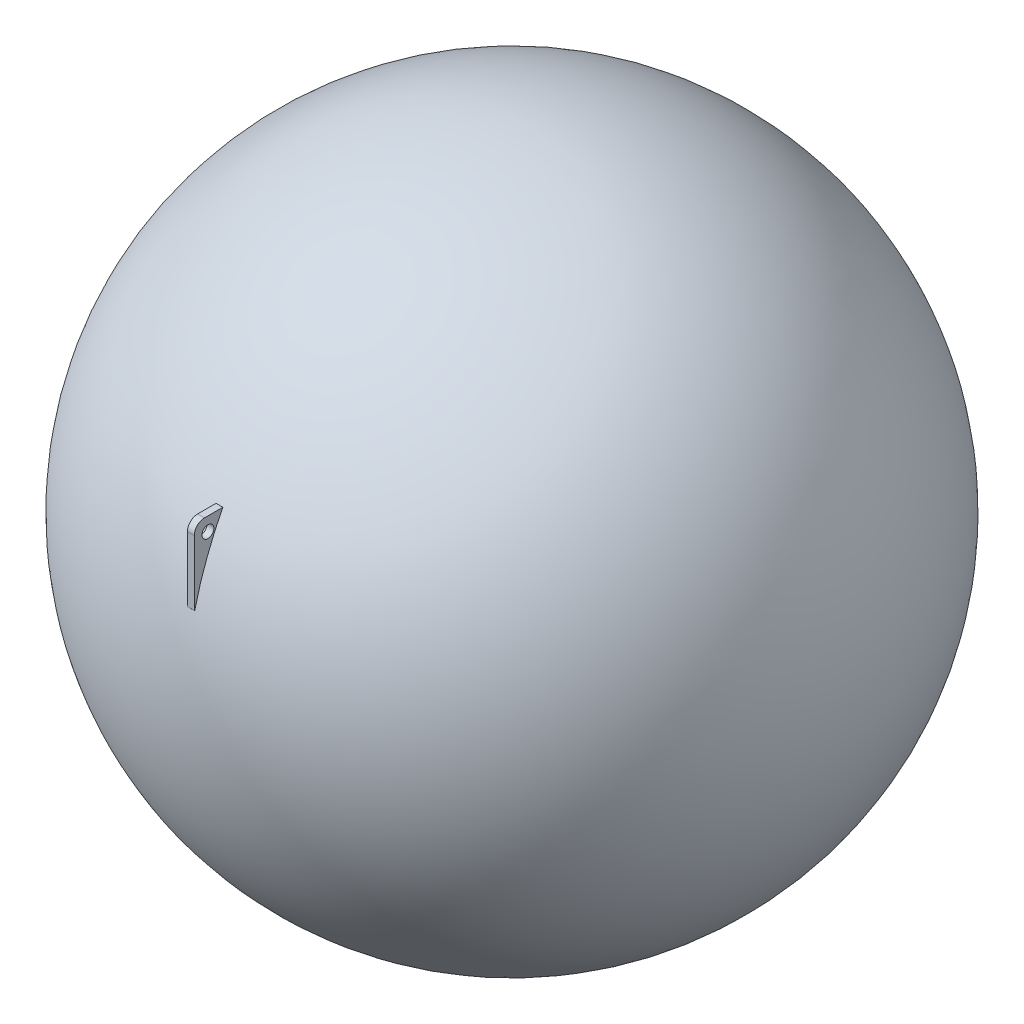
ISO-10303-21;
HEADER;
FILE_DESCRIPTION(('STEP AP214'),'2;1');
FILE_NAME('part.step','',(''),(''),'','','');
FILE_SCHEMA(('AUTOMOTIVE_DESIGN { 1 0 10303 214 1 1 1 1 }'));
ENDSEC;
DATA;
#1=APPLICATION_CONTEXT('core data for automotive mechanical design processes');
#2=APPLICATION_PROTOCOL_DEFINITION('international standard','automotive_design',2000,#1);
#3=PRODUCT_CONTEXT('',#1,'mechanical');
#4=PRODUCT('Part','Part','',(#3));
#5=PRODUCT_RELATED_PRODUCT_CATEGORY('part','',(#4));
#6=PRODUCT_DEFINITION_FORMATION('','',#4);
#7=PRODUCT_DEFINITION_CONTEXT('part definition',#1,'design');
#8=PRODUCT_DEFINITION('design','',#6,#7);
#9=PRODUCT_DEFINITION_SHAPE('','',#8);
#10=(LENGTH_UNIT() NAMED_UNIT(*) SI_UNIT(.MILLI.,.METRE.));
#11=(NAMED_UNIT(*) PLANE_ANGLE_UNIT() SI_UNIT($,.RADIAN.));
#12=(NAMED_UNIT(*) SI_UNIT($,.STERADIAN.) SOLID_ANGLE_UNIT());
#13=UNCERTAINTY_MEASURE_WITH_UNIT(LENGTH_MEASURE(1.E-05),#10,'distance_accuracy_value','');
#14=(GEOMETRIC_REPRESENTATION_CONTEXT(3) GLOBAL_UNCERTAINTY_ASSIGNED_CONTEXT((#13)) GLOBAL_UNIT_ASSIGNED_CONTEXT((#10,
#11,#12)) REPRESENTATION_CONTEXT('',''));
#15=CARTESIAN_POINT('',(0.,0.,0.));
#16=DIRECTION('',(0.,0.,1.));
#17=DIRECTION('',(1.,0.,0.));
#18=AXIS2_PLACEMENT_3D('',#15,#16,#17);
#19=CARTESIAN_POINT('',(0.,0.,0.));
#20=DIRECTION('',(0.,0.,-1.));
#21=DIRECTION('',(1.,0.,0.));
#22=AXIS2_PLACEMENT_3D('',#19,#20,#21);
#23=SPHERICAL_SURFACE('',#22,1225.55);
#24=CARTESIAN_POINT('',(-12.6999999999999,0.,0.));
#25=DIRECTION('',(-1.,0.,0.));
#26=DIRECTION('',(0.,-1.,0.));
#27=AXIS2_PLACEMENT_3D('',#24,#25,#26);
#28=CIRCLE('',#27,1225.48419512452);
#29=CARTESIAN_POINT('',(-12.7,285.75,1191.70401106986));
#30=VERTEX_POINT('',#29);
#31=CARTESIAN_POINT('',(-12.7,565.15,1087.38998983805));
#32=VERTEX_POINT('',#31);
#33=EDGE_CURVE('E100',#30,#32,#28,.T.);
#34=ORIENTED_EDGE('',*,*,#33,.T.);
#35=CARTESIAN_POINT('',(0.,565.15,0.));
#36=DIRECTION('',(0.,1.,0.));
#37=DIRECTION('',(0.,0.,1.));
#38=AXIS2_PLACEMENT_3D('',#35,#36,#37);
#39=CIRCLE('',#38,1087.46415113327);
#40=CARTESIAN_POINT('',(12.7,565.15,1087.38998983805));
#41=VERTEX_POINT('',#40);
#42=EDGE_CURVE('E96',#32,#41,#39,.T.);
#43=ORIENTED_EDGE('',*,*,#42,.T.);
#44=CARTESIAN_POINT('',(12.6999999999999,0.,0.));
#45=DIRECTION('',(1.,0.,0.));
#46=DIRECTION('',(0.,1.,0.));
#47=AXIS2_PLACEMENT_3D('',#44,#45,#46);
#48=CIRCLE('',#47,1225.48419512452);
#49=CARTESIAN_POINT('',(12.7,285.75,1191.70401106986));
#50=VERTEX_POINT('',#49);
#51=EDGE_CURVE('E87',#41,#50,#48,.T.);
#52=ORIENTED_EDGE('',*,*,#51,.T.);
#53=CARTESIAN_POINT('',(0.,285.75,0.));
#54=DIRECTION('',(0.,-1.,0.));
#55=DIRECTION('',(0.,0.,-1.));
#56=AXIS2_PLACEMENT_3D('',#53,#54,#55);
#57=CIRCLE('',#56,1191.77168115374);
#58=EDGE_CURVE('E95',#50,#30,#57,.T.);
#59=ORIENTED_EDGE('',*,*,#58,.T.);
#60=EDGE_LOOP('',(#34,#43,#52,#59));
#61=FACE_BOUND('',#60,.T.);
#62=ADVANCED_FACE('F40',(#61),#23,.F.);
#63=CARTESIAN_POINT('',(-12.7,285.75,-500000.));
#64=DIRECTION('',(0.,-1.,0.));
#65=DIRECTION('',(0.,0.,-1.));
#66=AXIS2_PLACEMENT_3D('',#63,#64,#65);
#67=PLANE('',#66);
#68=ORIENTED_EDGE('',*,*,#58,.F.);
#69=DIRECTION('',(0.,0.,1.));
#70=VECTOR('',#69,1.);
#71=CARTESIAN_POINT('',(12.7,285.75,-500000.));
#72=LINE('',#71,#70);
#73=CARTESIAN_POINT('',(12.7,285.75,1193.8));
#74=VERTEX_POINT('',#73);
#75=EDGE_CURVE('E93',#50,#74,#72,.T.);
#76=ORIENTED_EDGE('',*,*,#75,.T.);
#77=DIRECTION('',(1.,0.,0.));
#78=VECTOR('',#77,1.);
#79=CARTESIAN_POINT('',(-12.7,285.75,1193.8));
#80=LINE('',#79,#78);
#81=CARTESIAN_POINT('',(-12.7,285.75,1193.8));
#82=VERTEX_POINT('',#81);
#83=EDGE_CURVE('E121',#82,#74,#80,.T.);
#84=ORIENTED_EDGE('',*,*,#83,.F.);
#85=DIRECTION('',(0.,0.,1.));
#86=VECTOR('',#85,1.);
#87=CARTESIAN_POINT('',(-12.7,285.75,-500000.));
#88=LINE('',#87,#86);
#89=EDGE_CURVE('E108',#30,#82,#88,.T.);
#90=ORIENTED_EDGE('',*,*,#89,.F.);
#91=EDGE_LOOP('',(#68,#76,#84,#90));
#92=FACE_BOUND('',#91,.T.);
#93=ADVANCED_FACE('F132',(#92),#67,.T.);
#94=CARTESIAN_POINT('',(12.7,565.15,-500000.));
#95=DIRECTION('',(1.,0.,0.));
#96=DIRECTION('',(0.,1.,0.));
#97=AXIS2_PLACEMENT_3D('',#94,#95,#96);
#98=PLANE('',#97);
#99=CARTESIAN_POINT('',(12.7,514.35,1143.));
#100=DIRECTION('',(1.,0.,0.));
#101=DIRECTION('',(0.,1.,0.));
#102=AXIS2_PLACEMENT_3D('',#99,#100,#101);
#103=CIRCLE('',#102,22.2249999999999);
#104=CARTESIAN_POINT('',(12.7,536.575,1143.));
#105=VERTEX_POINT('',#104);
#106=EDGE_CURVE('E163',#105,#105,#103,.T.);
#107=ORIENTED_EDGE('',*,*,#106,.F.);
#108=EDGE_LOOP('',(#107));
#109=FACE_BOUND('',#108,.T.);
#110=DIRECTION('',(0.,0.,1.));
#111=VECTOR('',#110,1.);
#112=CARTESIAN_POINT('',(12.7,565.15,-500000.));
#113=LINE('',#112,#111);
#114=CARTESIAN_POINT('',(12.7,565.15,1155.70000000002));
#115=VERTEX_POINT('',#114);
#116=EDGE_CURVE('E90',#41,#115,#113,.T.);
#117=ORIENTED_EDGE('',*,*,#116,.T.);
#118=CARTESIAN_POINT('',(12.7,527.05,1155.7));
#119=DIRECTION('',(1.,0.,0.));
#120=DIRECTION('',(0.,1.,0.));
#121=AXIS2_PLACEMENT_3D('',#118,#119,#120);
#122=CIRCLE('',#121,38.1);
#123=CARTESIAN_POINT('',(12.7,527.05,1193.8));
#124=VERTEX_POINT('',#123);
#125=EDGE_CURVE('E12',#115,#124,#122,.T.);
#126=ORIENTED_EDGE('',*,*,#125,.T.);
#127=DIRECTION('',(0.,1.,0.));
#128=VECTOR('',#127,1.);
#129=CARTESIAN_POINT('',(12.7,565.15,1193.8));
#130=LINE('',#129,#128);
#131=EDGE_CURVE('E106',#74,#124,#130,.T.);
#132=ORIENTED_EDGE('',*,*,#131,.F.);
#133=ORIENTED_EDGE('',*,*,#75,.F.);
#134=ORIENTED_EDGE('',*,*,#51,.F.);
#135=EDGE_LOOP('',(#117,#126,#132,#133,#134));
#136=FACE_BOUND('',#135,.T.);
#137=ADVANCED_FACE('F89',(#109,#136),#98,.T.);
#138=CARTESIAN_POINT('',(0.,0.,1193.8));
#139=DIRECTION('',(0.,0.,1.));
#140=DIRECTION('',(1.,0.,0.));
#141=AXIS2_PLACEMENT_3D('',#138,#139,#140);
#142=PLANE('',#141);
#143=ORIENTED_EDGE('',*,*,#131,.T.);
#144=DIRECTION('',(-1.,0.,0.));
#145=VECTOR('',#144,1.);
#146=CARTESIAN_POINT('',(0.,527.05,1193.8));
#147=LINE('',#146,#145);
#148=CARTESIAN_POINT('',(-12.7,527.05,1193.8));
#149=VERTEX_POINT('',#148);
#150=EDGE_CURVE('E114',#124,#149,#147,.T.);
#151=ORIENTED_EDGE('',*,*,#150,.T.);
#152=DIRECTION('',(0.,-1.,0.));
#153=VECTOR('',#152,1.);
#154=CARTESIAN_POINT('',(-12.7,565.15,1193.8));
#155=LINE('',#154,#153);
#156=EDGE_CURVE('E117',#149,#82,#155,.T.);
#157=ORIENTED_EDGE('',*,*,#156,.T.);
#158=ORIENTED_EDGE('',*,*,#83,.T.);
#159=EDGE_LOOP('',(#143,#151,#157,#158));
#160=FACE_BOUND('',#159,.T.);
#161=ADVANCED_FACE('F133',(#160),#142,.T.);
#162=CARTESIAN_POINT('',(-12.7,565.15,-500000.));
#163=DIRECTION('',(-1.,0.,0.));
#164=DIRECTION('',(0.,-1.,0.));
#165=AXIS2_PLACEMENT_3D('',#162,#163,#164);
#166=PLANE('',#165);
#167=CARTESIAN_POINT('',(-12.7,514.35,1143.));
#168=DIRECTION('',(1.,0.,0.));
#169=DIRECTION('',(0.,1.,0.));
#170=AXIS2_PLACEMENT_3D('',#167,#168,#169);
#171=CIRCLE('',#170,22.2249999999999);
#172=CARTESIAN_POINT('',(-12.7,536.575,1143.));
#173=VERTEX_POINT('',#172);
#174=EDGE_CURVE('E101',#173,#173,#171,.T.);
#175=ORIENTED_EDGE('',*,*,#174,.T.);
#176=EDGE_LOOP('',(#175));
#177=FACE_BOUND('',#176,.T.);
#178=ORIENTED_EDGE('',*,*,#156,.F.);
#179=CARTESIAN_POINT('',(-12.7,527.05,1155.7));
#180=DIRECTION('',(-1.,0.,0.));
#181=DIRECTION('',(0.,-1.,0.));
#182=AXIS2_PLACEMENT_3D('',#179,#180,#181);
#183=CIRCLE('',#182,38.1);
#184=CARTESIAN_POINT('',(-12.7,565.15,1155.70000000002));
#185=VERTEX_POINT('',#184);
#186=EDGE_CURVE('E62',#149,#185,#183,.T.);
#187=ORIENTED_EDGE('',*,*,#186,.T.);
#188=DIRECTION('',(0.,0.,1.));
#189=VECTOR('',#188,1.);
#190=CARTESIAN_POINT('',(-12.7,565.15,-500000.));
#191=LINE('',#190,#189);
#192=EDGE_CURVE('E104',#32,#185,#191,.T.);
#193=ORIENTED_EDGE('',*,*,#192,.F.);
#194=ORIENTED_EDGE('',*,*,#33,.F.);
#195=ORIENTED_EDGE('',*,*,#89,.T.);
#196=EDGE_LOOP('',(#178,#187,#193,#194,#195));
#197=FACE_BOUND('',#196,.T.);
#198=ADVANCED_FACE('F130',(#177,#197),#166,.T.);
#199=CARTESIAN_POINT('',(-12.7,565.15,-500000.));
#200=DIRECTION('',(0.,1.,0.));
#201=DIRECTION('',(0.,0.,1.));
#202=AXIS2_PLACEMENT_3D('',#199,#200,#201);
#203=PLANE('',#202);
#204=ORIENTED_EDGE('',*,*,#192,.T.);
#205=DIRECTION('',(-1.,0.,0.));
#206=VECTOR('',#205,1.);
#207=CARTESIAN_POINT('',(-12.7,565.15,1155.70000000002));
#208=LINE('',#207,#206);
#209=EDGE_CURVE('E48',#185,#115,#208,.F.);
#210=ORIENTED_EDGE('',*,*,#209,.T.);
#211=ORIENTED_EDGE('',*,*,#116,.F.);
#212=ORIENTED_EDGE('',*,*,#42,.F.);
#213=EDGE_LOOP('',(#204,#210,#211,#212));
#214=FACE_BOUND('',#213,.T.);
#215=ADVANCED_FACE('F103',(#214),#203,.T.);
#216=CARTESIAN_POINT('',(-12.7,514.35,1143.));
#217=DIRECTION('',(1.,0.,0.));
#218=DIRECTION('',(0.,1.,0.));
#219=AXIS2_PLACEMENT_3D('',#216,#217,#218);
#220=CYLINDRICAL_SURFACE('',#219,22.2249999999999);
#221=ORIENTED_EDGE('',*,*,#174,.F.);
#222=EDGE_LOOP('',(#221));
#223=FACE_BOUND('',#222,.T.);
#224=ORIENTED_EDGE('',*,*,#106,.T.);
#225=EDGE_LOOP('',(#224));
#226=FACE_BOUND('',#225,.T.);
#227=ADVANCED_FACE('F136',(#223,#226),#220,.F.);
#228=CARTESIAN_POINT('',(0.,527.05,1155.7));
#229=DIRECTION('',(-1.,0.,0.));
#230=DIRECTION('',(0.,0.,1.));
#231=AXIS2_PLACEMENT_3D('',#228,#229,#230);
#232=CYLINDRICAL_SURFACE('',#231,38.1);
#233=ORIENTED_EDGE('',*,*,#125,.F.);
#234=ORIENTED_EDGE('',*,*,#209,.F.);
#235=ORIENTED_EDGE('',*,*,#186,.F.);
#236=ORIENTED_EDGE('',*,*,#150,.F.);
#237=EDGE_LOOP('',(#233,#234,#235,#236));
#238=FACE_BOUND('',#237,.T.);
#239=ADVANCED_FACE('F42',(#238),#232,.T.);
#240=CLOSED_SHELL('',(#62,#93,#137,#161,#198,#215,#227,#239));
#241=MANIFOLD_SOLID_BREP('B2',#240);
#242=CARTESIAN_POINT('',(0.,0.,0.));
#243=DIRECTION('',(0.,0.,-1.));
#244=DIRECTION('',(1.,0.,0.));
#245=AXIS2_PLACEMENT_3D('',#242,#243,#244);
#246=SPHERICAL_SURFACE('',#245,1225.55);
#247=CARTESIAN_POINT('',(0.,0.,-1225.55));
#248=VERTEX_POINT('',#247);
#249=VERTEX_LOOP('',#248);
#250=FACE_BOUND('',#249,.T.);
#251=ADVANCED_FACE('F210',(#250),#246,.T.);
#252=CLOSED_SHELL('',(#251));
#253=MANIFOLD_SOLID_BREP('B6_NOT_SHOWN',#252);
#254=ADVANCED_BREP_SHAPE_REPRESENTATION('',(#18,#241,#253),#14);
#255=SHAPE_DEFINITION_REPRESENTATION(#9,#254);
ENDSEC;
END-ISO-10303-21;
